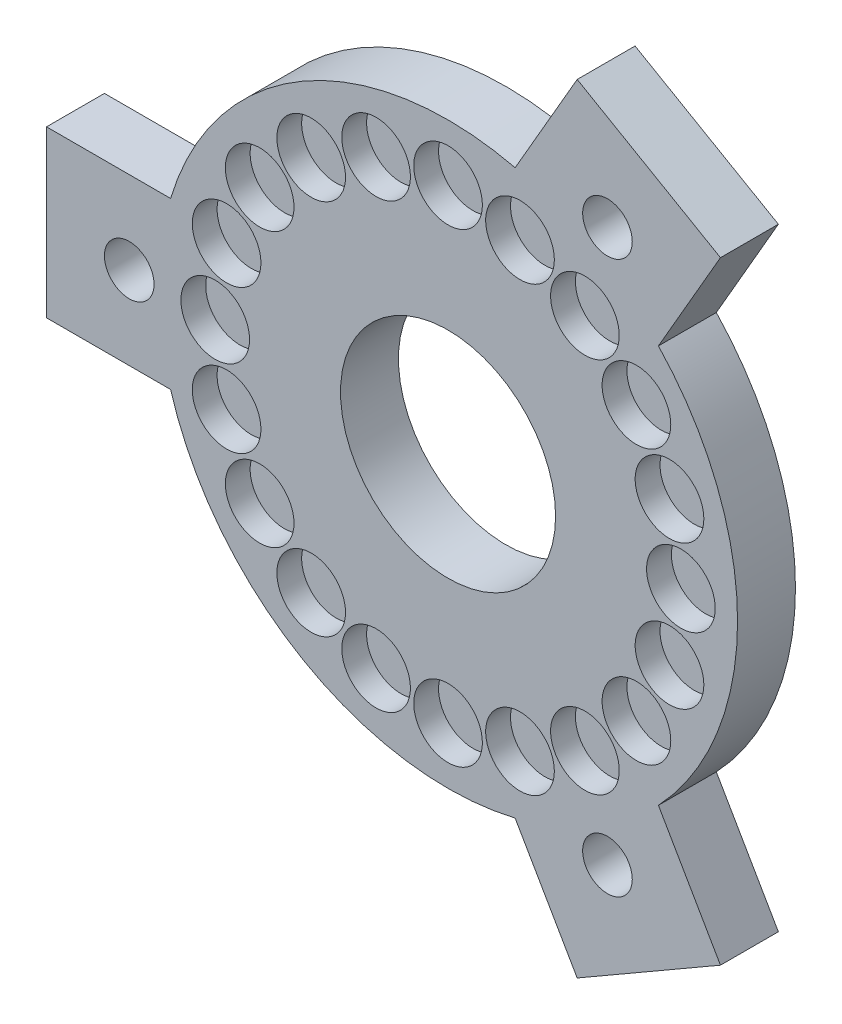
ISO-10303-21;
HEADER;
FILE_DESCRIPTION(('STEP AP214'),'2;1');
FILE_NAME('part.step','',(''),(''),'','','');
FILE_SCHEMA(('AUTOMOTIVE_DESIGN { 1 0 10303 214 1 1 1 1 }'));
ENDSEC;
DATA;
#1=APPLICATION_CONTEXT('core data for automotive mechanical design processes');
#2=APPLICATION_PROTOCOL_DEFINITION('international standard','automotive_design',2000,#1);
#3=PRODUCT_CONTEXT('',#1,'mechanical');
#4=PRODUCT('Part','Part','',(#3));
#5=PRODUCT_RELATED_PRODUCT_CATEGORY('part','',(#4));
#6=PRODUCT_DEFINITION_FORMATION('','',#4);
#7=PRODUCT_DEFINITION_CONTEXT('part definition',#1,'design');
#8=PRODUCT_DEFINITION('design','',#6,#7);
#9=PRODUCT_DEFINITION_SHAPE('','',#8);
#10=(LENGTH_UNIT() NAMED_UNIT(*) SI_UNIT(.MILLI.,.METRE.));
#11=(NAMED_UNIT(*) PLANE_ANGLE_UNIT() SI_UNIT($,.RADIAN.));
#12=(NAMED_UNIT(*) SI_UNIT($,.STERADIAN.) SOLID_ANGLE_UNIT());
#13=UNCERTAINTY_MEASURE_WITH_UNIT(LENGTH_MEASURE(1.E-05),#10,'distance_accuracy_value','');
#14=(GEOMETRIC_REPRESENTATION_CONTEXT(3) GLOBAL_UNCERTAINTY_ASSIGNED_CONTEXT((#13)) GLOBAL_UNIT_ASSIGNED_CONTEXT((#10,
#11,#12)) REPRESENTATION_CONTEXT('',''));
#15=CARTESIAN_POINT('',(0.,0.,0.));
#16=DIRECTION('',(0.,0.,1.));
#17=DIRECTION('',(1.,0.,0.));
#18=AXIS2_PLACEMENT_3D('',#15,#16,#17);
#19=CARTESIAN_POINT('',(0.,0.,7.));
#20=DIRECTION('',(0.,0.,-1.));
#21=DIRECTION('',(-1.,0.,0.));
#22=AXIS2_PLACEMENT_3D('',#19,#20,#21);
#23=CYLINDRICAL_SURFACE('',#22,35.);
#24=CARTESIAN_POINT('',(0.,0.,7.));
#25=DIRECTION('',(0.,0.,1.));
#26=DIRECTION('',(1.,0.,0.));
#27=AXIS2_PLACEMENT_3D('',#24,#25,#26);
#28=CIRCLE('',#27,35.);
#29=CARTESIAN_POINT('',(8.11025579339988,34.0473750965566,7.));
#30=VERTEX_POINT('',#29);
#31=CARTESIAN_POINT('',(-33.5410196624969,10.,7.));
#32=VERTEX_POINT('',#31);
#33=EDGE_CURVE('E126',#30,#32,#28,.T.);
#34=ORIENTED_EDGE('',*,*,#33,.F.);
#35=DIRECTION('',(0.,0.,-1.));
#36=VECTOR('',#35,1.);
#37=CARTESIAN_POINT('',(8.11025579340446,34.047375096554,7.));
#38=LINE('',#37,#36);
#39=CARTESIAN_POINT('',(8.11025579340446,34.047375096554,0.));
#40=VERTEX_POINT('',#39);
#41=EDGE_CURVE('E1253',#30,#40,#38,.T.);
#42=ORIENTED_EDGE('',*,*,#41,.T.);
#43=CARTESIAN_POINT('',(0.,0.,0.));
#44=DIRECTION('',(0.,0.,1.));
#45=DIRECTION('',(1.,0.,0.));
#46=AXIS2_PLACEMENT_3D('',#43,#44,#45);
#47=CIRCLE('',#46,35.);
#48=CARTESIAN_POINT('',(-33.5410196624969,10.,0.));
#49=VERTEX_POINT('',#48);
#50=EDGE_CURVE('E532',#40,#49,#47,.T.);
#51=ORIENTED_EDGE('',*,*,#50,.T.);
#52=DIRECTION('',(0.,0.,-1.));
#53=VECTOR('',#52,1.);
#54=CARTESIAN_POINT('',(-33.5410196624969,10.,7.));
#55=LINE('',#54,#53);
#56=EDGE_CURVE('E251',#32,#49,#55,.T.);
#57=ORIENTED_EDGE('',*,*,#56,.F.);
#58=EDGE_LOOP('',(#34,#42,#51,#57));
#59=FACE_BOUND('',#58,.T.);
#60=ADVANCED_FACE('F116',(#59),#23,.T.);
#61=CARTESIAN_POINT('',(-33.5410196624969,-10.,7.));
#62=VERTEX_POINT('',#61);
#63=CARTESIAN_POINT('',(8.11025579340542,-34.0473750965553,7.));
#64=VERTEX_POINT('',#63);
#65=EDGE_CURVE('E127',#62,#64,#28,.T.);
#66=ORIENTED_EDGE('',*,*,#65,.F.);
#67=DIRECTION('',(0.,0.,-1.));
#68=VECTOR('',#67,1.);
#69=CARTESIAN_POINT('',(-33.5410196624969,-9.99999999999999,7.));
#70=LINE('',#69,#68);
#71=CARTESIAN_POINT('',(-33.5410196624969,-9.99999999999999,0.));
#72=VERTEX_POINT('',#71);
#73=EDGE_CURVE('E255',#62,#72,#70,.T.);
#74=ORIENTED_EDGE('',*,*,#73,.T.);
#75=CARTESIAN_POINT('',(8.11025579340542,-34.0473750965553,0.));
#76=VERTEX_POINT('',#75);
#77=EDGE_CURVE('E487',#72,#76,#47,.T.);
#78=ORIENTED_EDGE('',*,*,#77,.T.);
#79=DIRECTION('',(0.,0.,-1.));
#80=VECTOR('',#79,1.);
#81=CARTESIAN_POINT('',(8.11025579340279,-34.0473750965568,7.));
#82=LINE('',#81,#80);
#83=EDGE_CURVE('E298',#64,#76,#82,.T.);
#84=ORIENTED_EDGE('',*,*,#83,.F.);
#85=EDGE_LOOP('',(#66,#74,#78,#84));
#86=FACE_BOUND('',#85,.T.);
#87=ADVANCED_FACE('F503',(#86),#23,.T.);
#88=CARTESIAN_POINT('',(25.4307638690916,-24.0473750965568,0.));
#89=VERTEX_POINT('',#88);
#90=CARTESIAN_POINT('',(25.4307638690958,24.0473750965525,0.));
#91=VERTEX_POINT('',#90);
#92=EDGE_CURVE('E120',#89,#91,#47,.T.);
#93=ORIENTED_EDGE('',*,*,#92,.T.);
#94=DIRECTION('',(0.,0.,-1.));
#95=VECTOR('',#94,1.);
#96=CARTESIAN_POINT('',(25.4307638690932,24.047375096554,7.));
#97=LINE('',#96,#95);
#98=CARTESIAN_POINT('',(25.4307638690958,24.0473750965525,7.));
#99=VERTEX_POINT('',#98);
#100=EDGE_CURVE('E141',#99,#91,#97,.T.);
#101=ORIENTED_EDGE('',*,*,#100,.F.);
#102=CARTESIAN_POINT('',(25.4307638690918,-24.0473750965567,7.));
#103=VERTEX_POINT('',#102);
#104=EDGE_CURVE('E12',#103,#99,#28,.T.);
#105=ORIENTED_EDGE('',*,*,#104,.F.);
#106=DIRECTION('',(0.,0.,-1.));
#107=VECTOR('',#106,1.);
#108=CARTESIAN_POINT('',(25.4307638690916,-24.0473750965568,7.));
#109=LINE('',#108,#107);
#110=EDGE_CURVE('E316',#103,#89,#109,.T.);
#111=ORIENTED_EDGE('',*,*,#110,.T.);
#112=EDGE_LOOP('',(#93,#101,#105,#111));
#113=FACE_BOUND('',#112,.T.);
#114=ADVANCED_FACE('F118',(#113),#23,.T.);
#115=CARTESIAN_POINT('',(0.,0.,7.));
#116=DIRECTION('',(0.,0.,1.));
#117=DIRECTION('',(1.,0.,0.));
#118=AXIS2_PLACEMENT_3D('',#115,#116,#117);
#119=PLANE('',#118);
#120=CARTESIAN_POINT('',(-38.5410196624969,0.,7.));
#121=DIRECTION('',(0.,0.,1.));
#122=DIRECTION('',(1.,0.,0.));
#123=AXIS2_PLACEMENT_3D('',#120,#121,#122);
#124=CIRCLE('',#123,3.);
#125=CARTESIAN_POINT('',(-35.5410196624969,0.,7.));
#126=VERTEX_POINT('',#125);
#127=EDGE_CURVE('E1227',#126,#126,#124,.F.);
#128=ORIENTED_EDGE('',*,*,#127,.T.);
#129=EDGE_LOOP('',(#128));
#130=FACE_BOUND('',#129,.T.);
#131=CARTESIAN_POINT('',(19.2705098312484,-33.3775021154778,7.));
#132=DIRECTION('',(0.,0.,1.));
#133=DIRECTION('',(1.,0.,0.));
#134=AXIS2_PLACEMENT_3D('',#131,#132,#133);
#135=CIRCLE('',#134,3.);
#136=CARTESIAN_POINT('',(22.2705098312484,-33.3775021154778,7.));
#137=VERTEX_POINT('',#136);
#138=EDGE_CURVE('E1233',#137,#137,#135,.F.);
#139=ORIENTED_EDGE('',*,*,#138,.T.);
#140=EDGE_LOOP('',(#139));
#141=FACE_BOUND('',#140,.T.);
#142=CARTESIAN_POINT('',(19.2705098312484,33.3775021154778,7.));
#143=DIRECTION('',(0.,0.,1.));
#144=DIRECTION('',(1.,0.,0.));
#145=AXIS2_PLACEMENT_3D('',#142,#143,#144);
#146=CIRCLE('',#145,3.);
#147=CARTESIAN_POINT('',(22.2705098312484,33.3775021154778,7.));
#148=VERTEX_POINT('',#147);
#149=EDGE_CURVE('E1243',#148,#148,#146,.F.);
#150=ORIENTED_EDGE('',*,*,#149,.T.);
#151=EDGE_LOOP('',(#150));
#152=FACE_BOUND('',#151,.T.);
#153=ORIENTED_EDGE('',*,*,#104,.T.);
#154=DIRECTION('',(-0.5,-0.866025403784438,0.));
#155=VECTOR('',#154,1.);
#156=CARTESIAN_POINT('',(32.9307638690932,37.0377561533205,7.));
#157=LINE('',#156,#155);
#158=CARTESIAN_POINT('',(32.9307638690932,37.0377561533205,7.));
#159=VERTEX_POINT('',#158);
#160=EDGE_CURVE('E233',#159,#99,#157,.T.);
#161=ORIENTED_EDGE('',*,*,#160,.F.);
#162=DIRECTION('',(0.866025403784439,-0.5,0.));
#163=VECTOR('',#162,1.);
#164=CARTESIAN_POINT('',(32.9307638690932,37.0377561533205,7.));
#165=LINE('',#164,#163);
#166=CARTESIAN_POINT('',(15.6102557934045,47.0377561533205,7.));
#167=VERTEX_POINT('',#166);
#168=EDGE_CURVE('E213',#167,#159,#165,.T.);
#169=ORIENTED_EDGE('',*,*,#168,.F.);
#170=DIRECTION('',(0.500000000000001,0.866025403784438,0.));
#171=VECTOR('',#170,1.);
#172=CARTESIAN_POINT('',(15.6102557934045,47.0377561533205,7.));
#173=LINE('',#172,#171);
#174=EDGE_CURVE('E238',#30,#167,#173,.T.);
#175=ORIENTED_EDGE('',*,*,#174,.F.);
#176=ORIENTED_EDGE('',*,*,#33,.T.);
#177=DIRECTION('',(1.,0.,0.));
#178=VECTOR('',#177,1.);
#179=CARTESIAN_POINT('',(-48.5410196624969,10.,7.));
#180=LINE('',#179,#178);
#181=CARTESIAN_POINT('',(-48.5410196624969,10.,7.));
#182=VERTEX_POINT('',#181);
#183=EDGE_CURVE('E278',#182,#32,#180,.T.);
#184=ORIENTED_EDGE('',*,*,#183,.F.);
#185=DIRECTION('',(0.,1.,0.));
#186=VECTOR('',#185,1.);
#187=CARTESIAN_POINT('',(-48.5410196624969,10.,7.));
#188=LINE('',#187,#186);
#189=CARTESIAN_POINT('',(-48.5410196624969,-9.99999999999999,7.));
#190=VERTEX_POINT('',#189);
#191=EDGE_CURVE('E266',#190,#182,#188,.T.);
#192=ORIENTED_EDGE('',*,*,#191,.F.);
#193=DIRECTION('',(-1.,0.,0.));
#194=VECTOR('',#193,1.);
#195=CARTESIAN_POINT('',(-48.5410196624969,-9.99999999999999,7.));
#196=LINE('',#195,#194);
#197=EDGE_CURVE('E250',#62,#190,#196,.T.);
#198=ORIENTED_EDGE('',*,*,#197,.F.);
#199=ORIENTED_EDGE('',*,*,#65,.T.);
#200=DIRECTION('',(-0.5,0.866025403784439,0.));
#201=VECTOR('',#200,1.);
#202=CARTESIAN_POINT('',(15.6102557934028,-47.0377561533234,7.));
#203=LINE('',#202,#201);
#204=CARTESIAN_POINT('',(15.6102557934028,-47.0377561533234,7.));
#205=VERTEX_POINT('',#204);
#206=EDGE_CURVE('E285',#205,#64,#203,.T.);
#207=ORIENTED_EDGE('',*,*,#206,.F.);
#208=DIRECTION('',(-0.866025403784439,-0.5,0.));
#209=VECTOR('',#208,1.);
#210=CARTESIAN_POINT('',(15.6102557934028,-47.0377561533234,7.));
#211=LINE('',#210,#209);
#212=CARTESIAN_POINT('',(32.9307638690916,-37.0377561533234,7.));
#213=VERTEX_POINT('',#212);
#214=EDGE_CURVE('E294',#213,#205,#211,.T.);
#215=ORIENTED_EDGE('',*,*,#214,.F.);
#216=DIRECTION('',(0.5,-0.866025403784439,0.));
#217=VECTOR('',#216,1.);
#218=CARTESIAN_POINT('',(32.9307638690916,-37.0377561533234,7.));
#219=LINE('',#218,#217);
#220=EDGE_CURVE('E289',#103,#213,#219,.T.);
#221=ORIENTED_EDGE('',*,*,#220,.F.);
#222=EDGE_LOOP('',(#153,#161,#169,#175,#176,#184,#192,#198,#199,#207,#215,#221));
#223=FACE_BOUND('',#222,.T.);
#224=CARTESIAN_POINT('',(0.,0.,7.));
#225=DIRECTION('',(0.,0.,1.));
#226=DIRECTION('',(1.,0.,0.));
#227=AXIS2_PLACEMENT_3D('',#224,#225,#226);
#228=CIRCLE('',#227,13.);
#229=CARTESIAN_POINT('',(13.,0.,7.));
#230=VERTEX_POINT('',#229);
#231=EDGE_CURVE('E312',#230,#230,#228,.T.);
#232=ORIENTED_EDGE('',*,*,#231,.F.);
#233=EDGE_LOOP('',(#232));
#234=FACE_BOUND('',#233,.T.);
#235=CARTESIAN_POINT('',(28.1500000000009,9.17469042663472E-13,7.));
#236=DIRECTION('',(0.,0.,1.));
#237=DIRECTION('',(1.,0.,0.));
#238=AXIS2_PLACEMENT_3D('',#235,#236,#237);
#239=CIRCLE('',#238,4.15);
#240=CARTESIAN_POINT('',(32.3000000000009,9.17469042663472E-13,7.));
#241=VERTEX_POINT('',#240);
#242=EDGE_CURVE('E373',#241,#241,#239,.T.);
#243=ORIENTED_EDGE('',*,*,#242,.F.);
#244=EDGE_LOOP('',(#243));
#245=FACE_BOUND('',#244,.T.);
#246=CARTESIAN_POINT('',(26.7722409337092,8.69882839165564,7.));
#247=DIRECTION('',(0.,0.,1.));
#248=DIRECTION('',(1.,0.,0.));
#249=AXIS2_PLACEMENT_3D('',#246,#247,#248);
#250=CIRCLE('',#249,4.15);
#251=CARTESIAN_POINT('',(30.9222409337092,8.69882839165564,7.));
#252=VERTEX_POINT('',#251);
#253=EDGE_CURVE('E382',#252,#252,#250,.T.);
#254=ORIENTED_EDGE('',*,*,#253,.F.);
#255=EDGE_LOOP('',(#254));
#256=FACE_BOUND('',#255,.T.);
#257=CARTESIAN_POINT('',(22.7738283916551,16.5461548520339,7.));
#258=DIRECTION('',(0.,0.,1.));
#259=DIRECTION('',(1.,0.,0.));
#260=AXIS2_PLACEMENT_3D('',#257,#258,#259);
#261=CIRCLE('',#260,4.15);
#262=CARTESIAN_POINT('',(26.9238283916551,16.5461548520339,7.));
#263=VERTEX_POINT('',#262);
#264=EDGE_CURVE('E355',#263,#263,#261,.T.);
#265=ORIENTED_EDGE('',*,*,#264,.F.);
#266=EDGE_LOOP('',(#265));
#267=FACE_BOUND('',#266,.T.);
#268=CARTESIAN_POINT('',(8.69882839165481,26.7722409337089,7.));
#269=DIRECTION('',(0.,0.,1.));
#270=DIRECTION('',(1.,0.,0.));
#271=AXIS2_PLACEMENT_3D('',#268,#269,#270);
#272=CIRCLE('',#271,4.15);
#273=CARTESIAN_POINT('',(12.8488283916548,26.7722409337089,7.));
#274=VERTEX_POINT('',#273);
#275=EDGE_CURVE('E364',#274,#274,#272,.T.);
#276=ORIENTED_EDGE('',*,*,#275,.F.);
#277=EDGE_LOOP('',(#276));
#278=FACE_BOUND('',#277,.T.);
#279=CARTESIAN_POINT('',(16.5461548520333,22.7738283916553,7.));
#280=DIRECTION('',(0.,0.,1.));
#281=DIRECTION('',(1.,0.,0.));
#282=AXIS2_PLACEMENT_3D('',#279,#280,#281);
#283=CIRCLE('',#282,4.15);
#284=CARTESIAN_POINT('',(20.6961548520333,22.7738283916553,7.));
#285=VERTEX_POINT('',#284);
#286=EDGE_CURVE('E405',#285,#285,#283,.T.);
#287=ORIENTED_EDGE('',*,*,#286,.F.);
#288=EDGE_LOOP('',(#287));
#289=FACE_BOUND('',#288,.T.);
#290=CARTESIAN_POINT('',(8.69882839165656,-26.7722409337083,7.));
#291=DIRECTION('',(0.,0.,1.));
#292=DIRECTION('',(1.,0.,0.));
#293=AXIS2_PLACEMENT_3D('',#290,#291,#292);
#294=CIRCLE('',#293,4.15);
#295=CARTESIAN_POINT('',(12.8488283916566,-26.7722409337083,7.));
#296=VERTEX_POINT('',#295);
#297=EDGE_CURVE('E414',#296,#296,#294,.T.);
#298=ORIENTED_EDGE('',*,*,#297,.F.);
#299=EDGE_LOOP('',(#298));
#300=FACE_BOUND('',#299,.T.);
#301=CARTESIAN_POINT('',(16.5461548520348,-22.7738283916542,7.));
#302=DIRECTION('',(0.,0.,1.));
#303=DIRECTION('',(1.,0.,0.));
#304=AXIS2_PLACEMENT_3D('',#301,#302,#303);
#305=CIRCLE('',#304,4.15);
#306=CARTESIAN_POINT('',(20.6961548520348,-22.7738283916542,7.));
#307=VERTEX_POINT('',#306);
#308=EDGE_CURVE('E389',#307,#307,#305,.T.);
#309=ORIENTED_EDGE('',*,*,#308,.F.);
#310=EDGE_LOOP('',(#309));
#311=FACE_BOUND('',#310,.T.);
#312=CARTESIAN_POINT('',(26.7722409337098,-8.6988283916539,7.));
#313=DIRECTION('',(0.,0.,1.));
#314=DIRECTION('',(1.,0.,0.));
#315=AXIS2_PLACEMENT_3D('',#312,#313,#314);
#316=CIRCLE('',#315,4.15);
#317=CARTESIAN_POINT('',(30.9222409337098,-8.6988283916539,7.));
#318=VERTEX_POINT('',#317);
#319=EDGE_CURVE('E398',#318,#318,#316,.T.);
#320=ORIENTED_EDGE('',*,*,#319,.F.);
#321=EDGE_LOOP('',(#320));
#322=FACE_BOUND('',#321,.T.);
#323=CARTESIAN_POINT('',(-26.7722409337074,-8.69882839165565,7.));
#324=DIRECTION('',(0.,0.,1.));
#325=DIRECTION('',(1.,0.,0.));
#326=AXIS2_PLACEMENT_3D('',#323,#324,#325);
#327=CIRCLE('',#326,4.15);
#328=CARTESIAN_POINT('',(-22.6222409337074,-8.69882839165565,7.));
#329=VERTEX_POINT('',#328);
#330=EDGE_CURVE('E438',#329,#329,#327,.T.);
#331=ORIENTED_EDGE('',*,*,#330,.F.);
#332=EDGE_LOOP('',(#331));
#333=FACE_BOUND('',#332,.T.);
#334=CARTESIAN_POINT('',(-22.7738283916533,-16.5461548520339,7.));
#335=DIRECTION('',(0.,0.,1.));
#336=DIRECTION('',(1.,0.,0.));
#337=AXIS2_PLACEMENT_3D('',#334,#335,#336);
#338=CIRCLE('',#337,4.15);
#339=CARTESIAN_POINT('',(-18.6238283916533,-16.5461548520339,7.));
#340=VERTEX_POINT('',#339);
#341=EDGE_CURVE('E439',#340,#340,#338,.T.);
#342=ORIENTED_EDGE('',*,*,#341,.F.);
#343=EDGE_LOOP('',(#342));
#344=FACE_BOUND('',#343,.T.);
#345=CARTESIAN_POINT('',(-28.1499999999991,-9.20916423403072E-13,7.));
#346=DIRECTION('',(0.,0.,1.));
#347=DIRECTION('',(1.,0.,0.));
#348=AXIS2_PLACEMENT_3D('',#345,#346,#347);
#349=CIRCLE('',#348,4.15);
#350=CARTESIAN_POINT('',(-23.9999999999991,-9.20916423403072E-13,7.));
#351=VERTEX_POINT('',#350);
#352=EDGE_CURVE('E430',#351,#351,#349,.T.);
#353=ORIENTED_EDGE('',*,*,#352,.F.);
#354=EDGE_LOOP('',(#353));
#355=FACE_BOUND('',#354,.T.);
#356=CARTESIAN_POINT('',(-26.7722409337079,8.69882839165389,7.));
#357=DIRECTION('',(0.,0.,1.));
#358=DIRECTION('',(1.,0.,0.));
#359=AXIS2_PLACEMENT_3D('',#356,#357,#358);
#360=CIRCLE('',#359,4.15);
#361=CARTESIAN_POINT('',(-22.6222409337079,8.69882839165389,7.));
#362=VERTEX_POINT('',#361);
#363=EDGE_CURVE('E421',#362,#362,#360,.T.);
#364=ORIENTED_EDGE('',*,*,#363,.F.);
#365=EDGE_LOOP('',(#364));
#366=FACE_BOUND('',#365,.T.);
#367=CARTESIAN_POINT('',(0.,28.15,7.));
#368=DIRECTION('',(0.,0.,1.));
#369=DIRECTION('',(1.,0.,0.));
#370=AXIS2_PLACEMENT_3D('',#367,#368,#369);
#371=CIRCLE('',#370,4.15);
#372=CARTESIAN_POINT('',(4.15,28.15,7.));
#373=VERTEX_POINT('',#372);
#374=EDGE_CURVE('E372',#373,#373,#371,.T.);
#375=ORIENTED_EDGE('',*,*,#374,.F.);
#376=EDGE_LOOP('',(#375));
#377=FACE_BOUND('',#376,.T.);
#378=CARTESIAN_POINT('',(-8.69882839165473,26.7722409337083,7.));
#379=DIRECTION('',(0.,0.,1.));
#380=DIRECTION('',(1.,0.,0.));
#381=AXIS2_PLACEMENT_3D('',#378,#379,#380);
#382=CIRCLE('',#381,4.15);
#383=CARTESIAN_POINT('',(-4.54882839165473,26.7722409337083,7.));
#384=VERTEX_POINT('',#383);
#385=EDGE_CURVE('E476',#384,#384,#382,.T.);
#386=ORIENTED_EDGE('',*,*,#385,.F.);
#387=EDGE_LOOP('',(#386));
#388=FACE_BOUND('',#387,.T.);
#389=CARTESIAN_POINT('',(-22.7738283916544,16.5461548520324,7.));
#390=DIRECTION('',(0.,0.,1.));
#391=DIRECTION('',(1.,0.,0.));
#392=AXIS2_PLACEMENT_3D('',#389,#390,#391);
#393=CIRCLE('',#392,4.15);
#394=CARTESIAN_POINT('',(-18.6238283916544,16.5461548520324,7.));
#395=VERTEX_POINT('',#394);
#396=EDGE_CURVE('E453',#395,#395,#393,.T.);
#397=ORIENTED_EDGE('',*,*,#396,.F.);
#398=EDGE_LOOP('',(#397));
#399=FACE_BOUND('',#398,.T.);
#400=CARTESIAN_POINT('',(-16.546154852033,22.7738283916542,7.));
#401=DIRECTION('',(0.,0.,1.));
#402=DIRECTION('',(1.,0.,0.));
#403=AXIS2_PLACEMENT_3D('',#400,#401,#402);
#404=CIRCLE('',#403,4.15);
#405=CARTESIAN_POINT('',(-12.396154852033,22.7738283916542,7.));
#406=VERTEX_POINT('',#405);
#407=EDGE_CURVE('E461',#406,#406,#404,.T.);
#408=ORIENTED_EDGE('',*,*,#407,.F.);
#409=EDGE_LOOP('',(#408));
#410=FACE_BOUND('',#409,.T.);
#411=CARTESIAN_POINT('',(-8.69882839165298,-26.7722409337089,7.));
#412=DIRECTION('',(0.,0.,1.));
#413=DIRECTION('',(1.,0.,0.));
#414=AXIS2_PLACEMENT_3D('',#411,#412,#413);
#415=CIRCLE('',#414,4.15);
#416=CARTESIAN_POINT('',(-4.54882839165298,-26.7722409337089,7.));
#417=VERTEX_POINT('',#416);
#418=EDGE_CURVE('E331',#417,#417,#415,.T.);
#419=ORIENTED_EDGE('',*,*,#418,.F.);
#420=EDGE_LOOP('',(#419));
#421=FACE_BOUND('',#420,.T.);
#422=CARTESIAN_POINT('',(-16.5461548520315,-22.7738283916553,7.));
#423=DIRECTION('',(0.,0.,1.));
#424=DIRECTION('',(1.,0.,0.));
#425=AXIS2_PLACEMENT_3D('',#422,#423,#424);
#426=CIRCLE('',#425,4.15);
#427=CARTESIAN_POINT('',(-12.3961548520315,-22.7738283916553,7.));
#428=VERTEX_POINT('',#427);
#429=EDGE_CURVE('E341',#428,#428,#426,.T.);
#430=ORIENTED_EDGE('',*,*,#429,.F.);
#431=EDGE_LOOP('',(#430));
#432=FACE_BOUND('',#431,.T.);
#433=CARTESIAN_POINT('',(1.83493808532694E-12,-28.15,7.));
#434=DIRECTION('',(0.,0.,1.));
#435=DIRECTION('',(1.,0.,0.));
#436=AXIS2_PLACEMENT_3D('',#433,#434,#435);
#437=CIRCLE('',#436,4.15);
#438=CARTESIAN_POINT('',(4.15000000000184,-28.15,7.));
#439=VERTEX_POINT('',#438);
#440=EDGE_CURVE('E340',#439,#439,#437,.T.);
#441=ORIENTED_EDGE('',*,*,#440,.F.);
#442=EDGE_LOOP('',(#441));
#443=FACE_BOUND('',#442,.T.);
#444=CARTESIAN_POINT('',(22.7738283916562,-16.5461548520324,7.));
#445=DIRECTION('',(0.,0.,1.));
#446=DIRECTION('',(1.,0.,0.));
#447=AXIS2_PLACEMENT_3D('',#444,#445,#446);
#448=CIRCLE('',#447,4.15);
#449=CARTESIAN_POINT('',(26.9238283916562,-16.5461548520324,7.));
#450=VERTEX_POINT('',#449);
#451=EDGE_CURVE('E409',#450,#450,#448,.T.);
#452=ORIENTED_EDGE('',*,*,#451,.F.);
#453=EDGE_LOOP('',(#452));
#454=FACE_BOUND('',#453,.T.);
#455=ADVANCED_FACE('F494',(#130,#141,#152,#223,#234,#245,#256,#267,#278,#289,#300,#311,#322,
#333,#344,#355,#366,#377,#388,#399,#410,#421,#432,#443,#454),#119,.T.);
#456=CARTESIAN_POINT('',(0.,0.,0.));
#457=DIRECTION('',(0.,0.,1.));
#458=DIRECTION('',(1.,0.,0.));
#459=AXIS2_PLACEMENT_3D('',#456,#457,#458);
#460=PLANE('',#459);
#461=CARTESIAN_POINT('',(-38.5410196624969,0.,0.));
#462=DIRECTION('',(0.,0.,-1.));
#463=DIRECTION('',(-1.,0.,0.));
#464=AXIS2_PLACEMENT_3D('',#461,#462,#463);
#465=CIRCLE('',#464,3.);
#466=CARTESIAN_POINT('',(-41.5410196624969,0.,0.));
#467=VERTEX_POINT('',#466);
#468=EDGE_CURVE('E219',#467,#467,#465,.T.);
#469=ORIENTED_EDGE('',*,*,#468,.F.);
#470=EDGE_LOOP('',(#469));
#471=FACE_BOUND('',#470,.T.);
#472=CARTESIAN_POINT('',(19.2705098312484,-33.3775021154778,0.));
#473=DIRECTION('',(0.,0.,-1.));
#474=DIRECTION('',(-1.,0.,0.));
#475=AXIS2_PLACEMENT_3D('',#472,#473,#474);
#476=CIRCLE('',#475,3.);
#477=CARTESIAN_POINT('',(16.2705098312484,-33.3775021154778,0.));
#478=VERTEX_POINT('',#477);
#479=EDGE_CURVE('E1239',#478,#478,#476,.T.);
#480=ORIENTED_EDGE('',*,*,#479,.F.);
#481=EDGE_LOOP('',(#480));
#482=FACE_BOUND('',#481,.T.);
#483=CARTESIAN_POINT('',(19.2705098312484,33.3775021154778,0.));
#484=DIRECTION('',(0.,0.,-1.));
#485=DIRECTION('',(-1.,0.,0.));
#486=AXIS2_PLACEMENT_3D('',#483,#484,#485);
#487=CIRCLE('',#486,3.);
#488=CARTESIAN_POINT('',(16.2705098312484,33.3775021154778,0.));
#489=VERTEX_POINT('',#488);
#490=EDGE_CURVE('E1247',#489,#489,#487,.T.);
#491=ORIENTED_EDGE('',*,*,#490,.F.);
#492=EDGE_LOOP('',(#491));
#493=FACE_BOUND('',#492,.T.);
#494=CARTESIAN_POINT('',(0.,0.,0.));
#495=DIRECTION('',(0.,0.,1.));
#496=DIRECTION('',(1.,0.,0.));
#497=AXIS2_PLACEMENT_3D('',#494,#495,#496);
#498=CIRCLE('',#497,13.);
#499=CARTESIAN_POINT('',(13.,0.,0.));
#500=VERTEX_POINT('',#499);
#501=EDGE_CURVE('E326',#500,#500,#498,.F.);
#502=ORIENTED_EDGE('',*,*,#501,.F.);
#503=EDGE_LOOP('',(#502));
#504=FACE_BOUND('',#503,.T.);
#505=ORIENTED_EDGE('',*,*,#50,.F.);
#506=DIRECTION('',(0.500000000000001,0.866025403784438,0.));
#507=VECTOR('',#506,1.);
#508=CARTESIAN_POINT('',(15.6102557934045,47.0377561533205,0.));
#509=LINE('',#508,#507);
#510=CARTESIAN_POINT('',(15.6102557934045,47.0377561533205,0.));
#511=VERTEX_POINT('',#510);
#512=EDGE_CURVE('E227',#40,#511,#509,.T.);
#513=ORIENTED_EDGE('',*,*,#512,.T.);
#514=DIRECTION('',(0.866025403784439,-0.5,0.));
#515=VECTOR('',#514,1.);
#516=CARTESIAN_POINT('',(32.9307638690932,37.0377561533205,0.));
#517=LINE('',#516,#515);
#518=CARTESIAN_POINT('',(32.9307638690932,37.0377561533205,0.));
#519=VERTEX_POINT('',#518);
#520=EDGE_CURVE('E211',#511,#519,#517,.T.);
#521=ORIENTED_EDGE('',*,*,#520,.T.);
#522=DIRECTION('',(-0.5,-0.866025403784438,0.));
#523=VECTOR('',#522,1.);
#524=CARTESIAN_POINT('',(32.9307638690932,37.0377561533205,0.));
#525=LINE('',#524,#523);
#526=EDGE_CURVE('E222',#519,#91,#525,.T.);
#527=ORIENTED_EDGE('',*,*,#526,.T.);
#528=ORIENTED_EDGE('',*,*,#92,.F.);
#529=DIRECTION('',(0.5,-0.866025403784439,0.));
#530=VECTOR('',#529,1.);
#531=CARTESIAN_POINT('',(32.9307638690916,-37.0377561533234,0.));
#532=LINE('',#531,#530);
#533=CARTESIAN_POINT('',(32.9307638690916,-37.0377561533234,0.));
#534=VERTEX_POINT('',#533);
#535=EDGE_CURVE('E302',#89,#534,#532,.T.);
#536=ORIENTED_EDGE('',*,*,#535,.T.);
#537=DIRECTION('',(-0.866025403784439,-0.5,0.));
#538=VECTOR('',#537,1.);
#539=CARTESIAN_POINT('',(15.6102557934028,-47.0377561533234,0.));
#540=LINE('',#539,#538);
#541=CARTESIAN_POINT('',(15.6102557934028,-47.0377561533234,0.));
#542=VERTEX_POINT('',#541);
#543=EDGE_CURVE('E290',#534,#542,#540,.T.);
#544=ORIENTED_EDGE('',*,*,#543,.T.);
#545=DIRECTION('',(-0.5,0.866025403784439,0.));
#546=VECTOR('',#545,1.);
#547=CARTESIAN_POINT('',(15.6102557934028,-47.0377561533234,0.));
#548=LINE('',#547,#546);
#549=EDGE_CURVE('E274',#542,#76,#548,.T.);
#550=ORIENTED_EDGE('',*,*,#549,.T.);
#551=ORIENTED_EDGE('',*,*,#77,.F.);
#552=DIRECTION('',(-1.,0.,0.));
#553=VECTOR('',#552,1.);
#554=CARTESIAN_POINT('',(-48.5410196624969,-9.99999999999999,0.));
#555=LINE('',#554,#553);
#556=CARTESIAN_POINT('',(-48.5410196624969,-9.99999999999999,0.));
#557=VERTEX_POINT('',#556);
#558=EDGE_CURVE('E261',#72,#557,#555,.T.);
#559=ORIENTED_EDGE('',*,*,#558,.T.);
#560=DIRECTION('',(0.,1.,0.));
#561=VECTOR('',#560,1.);
#562=CARTESIAN_POINT('',(-48.5410196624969,10.,0.));
#563=LINE('',#562,#561);
#564=CARTESIAN_POINT('',(-48.5410196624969,10.,0.));
#565=VERTEX_POINT('',#564);
#566=EDGE_CURVE('E270',#557,#565,#563,.T.);
#567=ORIENTED_EDGE('',*,*,#566,.T.);
#568=DIRECTION('',(1.,0.,0.));
#569=VECTOR('',#568,1.);
#570=CARTESIAN_POINT('',(-48.5410196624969,10.,0.));
#571=LINE('',#570,#569);
#572=EDGE_CURVE('E265',#565,#49,#571,.T.);
#573=ORIENTED_EDGE('',*,*,#572,.T.);
#574=EDGE_LOOP('',(#505,#513,#521,#527,#528,#536,#544,#550,#551,#559,#567,#573));
#575=FACE_BOUND('',#574,.T.);
#576=ADVANCED_FACE('F230',(#471,#482,#493,#504,#575),#460,.F.);
#577=CARTESIAN_POINT('',(22.7738283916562,-16.5461548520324,4.));
#578=DIRECTION('',(0.,0.,1.));
#579=DIRECTION('',(1.,0.,0.));
#580=AXIS2_PLACEMENT_3D('',#577,#578,#579);
#581=CYLINDRICAL_SURFACE('',#580,4.15);
#582=CARTESIAN_POINT('',(22.7738283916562,-16.5461548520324,4.));
#583=DIRECTION('',(0.,0.,1.));
#584=DIRECTION('',(1.,0.,0.));
#585=AXIS2_PLACEMENT_3D('',#582,#583,#584);
#586=CIRCLE('',#585,4.15);
#587=CARTESIAN_POINT('',(26.9238283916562,-16.5461548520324,4.));
#588=VERTEX_POINT('',#587);
#589=EDGE_CURVE('E483',#588,#588,#586,.T.);
#590=ORIENTED_EDGE('',*,*,#589,.F.);
#591=EDGE_LOOP('',(#590));
#592=FACE_BOUND('',#591,.T.);
#593=ORIENTED_EDGE('',*,*,#451,.T.);
#594=EDGE_LOOP('',(#593));
#595=FACE_BOUND('',#594,.T.);
#596=ADVANCED_FACE('F492',(#592,#595),#581,.F.);
#597=CARTESIAN_POINT('',(0.,0.,4.));
#598=DIRECTION('',(0.,0.,1.));
#599=DIRECTION('',(1.,0.,0.));
#600=AXIS2_PLACEMENT_3D('',#597,#598,#599);
#601=PLANE('',#600);
#602=ORIENTED_EDGE('',*,*,#589,.T.);
#603=EDGE_LOOP('',(#602));
#604=FACE_BOUND('',#603,.T.);
#605=ADVANCED_FACE('F584',(#604),#601,.T.);
#606=CARTESIAN_POINT('',(1.83493808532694E-12,-28.15,4.));
#607=DIRECTION('',(0.,0.,1.));
#608=DIRECTION('',(1.,0.,0.));
#609=AXIS2_PLACEMENT_3D('',#606,#607,#608);
#610=CYLINDRICAL_SURFACE('',#609,4.15);
#611=CARTESIAN_POINT('',(1.83493808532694E-12,-28.15,4.));
#612=DIRECTION('',(0.,0.,1.));
#613=DIRECTION('',(1.,0.,0.));
#614=AXIS2_PLACEMENT_3D('',#611,#612,#613);
#615=CIRCLE('',#614,4.15);
#616=CARTESIAN_POINT('',(4.15000000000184,-28.15,4.));
#617=VERTEX_POINT('',#616);
#618=EDGE_CURVE('E330',#617,#617,#615,.T.);
#619=ORIENTED_EDGE('',*,*,#618,.F.);
#620=EDGE_LOOP('',(#619));
#621=FACE_BOUND('',#620,.T.);
#622=ORIENTED_EDGE('',*,*,#440,.T.);
#623=EDGE_LOOP('',(#622));
#624=FACE_BOUND('',#623,.T.);
#625=ADVANCED_FACE('F581',(#621,#624),#610,.F.);
#626=CARTESIAN_POINT('',(1.83493808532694E-12,-28.15,4.));
#627=DIRECTION('',(0.,0.,1.));
#628=DIRECTION('',(1.,0.,0.));
#629=AXIS2_PLACEMENT_3D('',#626,#627,#628);
#630=PLANE('',#629);
#631=ORIENTED_EDGE('',*,*,#618,.T.);
#632=EDGE_LOOP('',(#631));
#633=FACE_BOUND('',#632,.T.);
#634=ADVANCED_FACE('F576',(#633),#630,.T.);
#635=CARTESIAN_POINT('',(-16.5461548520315,-22.7738283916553,4.));
#636=DIRECTION('',(0.,0.,1.));
#637=DIRECTION('',(1.,0.,0.));
#638=AXIS2_PLACEMENT_3D('',#635,#636,#637);
#639=CYLINDRICAL_SURFACE('',#638,4.15);
#640=CARTESIAN_POINT('',(-16.5461548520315,-22.7738283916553,4.));
#641=DIRECTION('',(0.,0.,1.));
#642=DIRECTION('',(1.,0.,0.));
#643=AXIS2_PLACEMENT_3D('',#640,#641,#642);
#644=CIRCLE('',#643,4.15);
#645=CARTESIAN_POINT('',(-12.3961548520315,-22.7738283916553,4.));
#646=VERTEX_POINT('',#645);
#647=EDGE_CURVE('E335',#646,#646,#644,.T.);
#648=ORIENTED_EDGE('',*,*,#647,.F.);
#649=EDGE_LOOP('',(#648));
#650=FACE_BOUND('',#649,.T.);
#651=ORIENTED_EDGE('',*,*,#429,.T.);
#652=EDGE_LOOP('',(#651));
#653=FACE_BOUND('',#652,.T.);
#654=ADVANCED_FACE('F573',(#650,#653),#639,.F.);
#655=CARTESIAN_POINT('',(-16.5461548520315,-22.7738283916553,4.));
#656=DIRECTION('',(0.,0.,1.));
#657=DIRECTION('',(1.,0.,0.));
#658=AXIS2_PLACEMENT_3D('',#655,#656,#657);
#659=PLANE('',#658);
#660=ORIENTED_EDGE('',*,*,#647,.T.);
#661=EDGE_LOOP('',(#660));
#662=FACE_BOUND('',#661,.T.);
#663=ADVANCED_FACE('F567',(#662),#659,.T.);
#664=CARTESIAN_POINT('',(-8.69882839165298,-26.7722409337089,4.));
#665=DIRECTION('',(0.,0.,1.));
#666=DIRECTION('',(1.,0.,0.));
#667=AXIS2_PLACEMENT_3D('',#664,#665,#666);
#668=CYLINDRICAL_SURFACE('',#667,4.15);
#669=CARTESIAN_POINT('',(-8.69882839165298,-26.7722409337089,4.));
#670=DIRECTION('',(0.,0.,1.));
#671=DIRECTION('',(1.,0.,0.));
#672=AXIS2_PLACEMENT_3D('',#669,#670,#671);
#673=CIRCLE('',#672,4.15);
#674=CARTESIAN_POINT('',(-4.54882839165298,-26.7722409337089,4.));
#675=VERTEX_POINT('',#674);
#676=EDGE_CURVE('E336',#675,#675,#673,.T.);
#677=ORIENTED_EDGE('',*,*,#676,.F.);
#678=EDGE_LOOP('',(#677));
#679=FACE_BOUND('',#678,.T.);
#680=ORIENTED_EDGE('',*,*,#418,.T.);
#681=EDGE_LOOP('',(#680));
#682=FACE_BOUND('',#681,.T.);
#683=ADVANCED_FACE('F563',(#679,#682),#668,.F.);
#684=CARTESIAN_POINT('',(-8.69882839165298,-26.7722409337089,4.));
#685=DIRECTION('',(0.,0.,1.));
#686=DIRECTION('',(1.,0.,0.));
#687=AXIS2_PLACEMENT_3D('',#684,#685,#686);
#688=PLANE('',#687);
#689=ORIENTED_EDGE('',*,*,#676,.T.);
#690=EDGE_LOOP('',(#689));
#691=FACE_BOUND('',#690,.T.);
#692=ADVANCED_FACE('F566',(#691),#688,.T.);
#693=CARTESIAN_POINT('',(-16.546154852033,22.7738283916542,4.));
#694=DIRECTION('',(0.,0.,1.));
#695=DIRECTION('',(1.,0.,0.));
#696=AXIS2_PLACEMENT_3D('',#693,#694,#695);
#697=CYLINDRICAL_SURFACE('',#696,4.15);
#698=CARTESIAN_POINT('',(-16.546154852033,22.7738283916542,4.));
#699=DIRECTION('',(0.,0.,1.));
#700=DIRECTION('',(1.,0.,0.));
#701=AXIS2_PLACEMENT_3D('',#698,#699,#700);
#702=CIRCLE('',#701,4.15);
#703=CARTESIAN_POINT('',(-12.396154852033,22.7738283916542,4.));
#704=VERTEX_POINT('',#703);
#705=EDGE_CURVE('E457',#704,#704,#702,.T.);
#706=ORIENTED_EDGE('',*,*,#705,.F.);
#707=EDGE_LOOP('',(#706));
#708=FACE_BOUND('',#707,.T.);
#709=ORIENTED_EDGE('',*,*,#407,.T.);
#710=EDGE_LOOP('',(#709));
#711=FACE_BOUND('',#710,.T.);
#712=ADVANCED_FACE('F571',(#708,#711),#697,.F.);
#713=CARTESIAN_POINT('',(-16.546154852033,22.7738283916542,4.));
#714=DIRECTION('',(0.,0.,1.));
#715=DIRECTION('',(1.,0.,0.));
#716=AXIS2_PLACEMENT_3D('',#713,#714,#715);
#717=PLANE('',#716);
#718=ORIENTED_EDGE('',*,*,#705,.T.);
#719=EDGE_LOOP('',(#718));
#720=FACE_BOUND('',#719,.T.);
#721=ADVANCED_FACE('F689',(#720),#717,.T.);
#722=CARTESIAN_POINT('',(-22.7738283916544,16.5461548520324,4.));
#723=DIRECTION('',(0.,0.,1.));
#724=DIRECTION('',(1.,0.,0.));
#725=AXIS2_PLACEMENT_3D('',#722,#723,#724);
#726=CYLINDRICAL_SURFACE('',#725,4.15);
#727=CARTESIAN_POINT('',(-22.7738283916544,16.5461548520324,4.));
#728=DIRECTION('',(0.,0.,1.));
#729=DIRECTION('',(1.,0.,0.));
#730=AXIS2_PLACEMENT_3D('',#727,#728,#729);
#731=CIRCLE('',#730,4.15);
#732=CARTESIAN_POINT('',(-18.6238283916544,16.5461548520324,4.));
#733=VERTEX_POINT('',#732);
#734=EDGE_CURVE('E425',#733,#733,#731,.T.);
#735=ORIENTED_EDGE('',*,*,#734,.F.);
#736=EDGE_LOOP('',(#735));
#737=FACE_BOUND('',#736,.T.);
#738=ORIENTED_EDGE('',*,*,#396,.T.);
#739=EDGE_LOOP('',(#738));
#740=FACE_BOUND('',#739,.T.);
#741=ADVANCED_FACE('F685',(#737,#740),#726,.F.);
#742=CARTESIAN_POINT('',(-22.7738283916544,16.5461548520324,4.));
#743=DIRECTION('',(0.,0.,1.));
#744=DIRECTION('',(1.,0.,0.));
#745=AXIS2_PLACEMENT_3D('',#742,#743,#744);
#746=PLANE('',#745);
#747=ORIENTED_EDGE('',*,*,#734,.T.);
#748=EDGE_LOOP('',(#747));
#749=FACE_BOUND('',#748,.T.);
#750=ADVANCED_FACE('F688',(#749),#746,.T.);
#751=CARTESIAN_POINT('',(-8.69882839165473,26.7722409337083,4.));
#752=DIRECTION('',(0.,0.,1.));
#753=DIRECTION('',(1.,0.,0.));
#754=AXIS2_PLACEMENT_3D('',#751,#752,#753);
#755=CYLINDRICAL_SURFACE('',#754,4.15);
#756=CARTESIAN_POINT('',(-8.69882839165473,26.7722409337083,4.));
#757=DIRECTION('',(0.,0.,1.));
#758=DIRECTION('',(1.,0.,0.));
#759=AXIS2_PLACEMENT_3D('',#756,#757,#758);
#760=CIRCLE('',#759,4.15);
#761=CARTESIAN_POINT('',(-4.54882839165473,26.7722409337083,4.));
#762=VERTEX_POINT('',#761);
#763=EDGE_CURVE('E465',#762,#762,#760,.T.);
#764=ORIENTED_EDGE('',*,*,#763,.F.);
#765=EDGE_LOOP('',(#764));
#766=FACE_BOUND('',#765,.T.);
#767=ORIENTED_EDGE('',*,*,#385,.T.);
#768=EDGE_LOOP('',(#767));
#769=FACE_BOUND('',#768,.T.);
#770=ADVANCED_FACE('F693',(#766,#769),#755,.F.);
#771=CARTESIAN_POINT('',(-8.69882839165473,26.7722409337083,4.));
#772=DIRECTION('',(0.,0.,1.));
#773=DIRECTION('',(1.,0.,0.));
#774=AXIS2_PLACEMENT_3D('',#771,#772,#773);
#775=PLANE('',#774);
#776=ORIENTED_EDGE('',*,*,#763,.T.);
#777=EDGE_LOOP('',(#776));
#778=FACE_BOUND('',#777,.T.);
#779=ADVANCED_FACE('F704',(#778),#775,.T.);
#780=CARTESIAN_POINT('',(0.,28.15,4.));
#781=DIRECTION('',(0.,0.,1.));
#782=DIRECTION('',(1.,0.,0.));
#783=AXIS2_PLACEMENT_3D('',#780,#781,#782);
#784=CYLINDRICAL_SURFACE('',#783,4.15);
#785=CARTESIAN_POINT('',(0.,28.15,4.));
#786=DIRECTION('',(0.,0.,1.));
#787=DIRECTION('',(1.,0.,0.));
#788=AXIS2_PLACEMENT_3D('',#785,#786,#787);
#789=CIRCLE('',#788,4.15);
#790=CARTESIAN_POINT('',(4.15,28.15,4.));
#791=VERTEX_POINT('',#790);
#792=EDGE_CURVE('E472',#791,#791,#789,.T.);
#793=ORIENTED_EDGE('',*,*,#792,.F.);
#794=EDGE_LOOP('',(#793));
#795=FACE_BOUND('',#794,.T.);
#796=ORIENTED_EDGE('',*,*,#374,.T.);
#797=EDGE_LOOP('',(#796));
#798=FACE_BOUND('',#797,.T.);
#799=ADVANCED_FACE('F701',(#795,#798),#784,.F.);
#800=CARTESIAN_POINT('',(0.,28.15,4.));
#801=DIRECTION('',(0.,0.,1.));
#802=DIRECTION('',(1.,0.,0.));
#803=AXIS2_PLACEMENT_3D('',#800,#801,#802);
#804=PLANE('',#803);
#805=ORIENTED_EDGE('',*,*,#792,.T.);
#806=EDGE_LOOP('',(#805));
#807=FACE_BOUND('',#806,.T.);
#808=ADVANCED_FACE('F657',(#807),#804,.T.);
#809=CARTESIAN_POINT('',(-26.7722409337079,8.69882839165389,4.));
#810=DIRECTION('',(0.,0.,1.));
#811=DIRECTION('',(1.,0.,0.));
#812=AXIS2_PLACEMENT_3D('',#809,#810,#811);
#813=CYLINDRICAL_SURFACE('',#812,4.15);
#814=CARTESIAN_POINT('',(-26.7722409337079,8.69882839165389,4.));
#815=DIRECTION('',(0.,0.,1.));
#816=DIRECTION('',(1.,0.,0.));
#817=AXIS2_PLACEMENT_3D('',#814,#815,#816);
#818=CIRCLE('',#817,4.15);
#819=CARTESIAN_POINT('',(-22.6222409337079,8.69882839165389,4.));
#820=VERTEX_POINT('',#819);
#821=EDGE_CURVE('E426',#820,#820,#818,.T.);
#822=ORIENTED_EDGE('',*,*,#821,.F.);
#823=EDGE_LOOP('',(#822));
#824=FACE_BOUND('',#823,.T.);
#825=ORIENTED_EDGE('',*,*,#363,.T.);
#826=EDGE_LOOP('',(#825));
#827=FACE_BOUND('',#826,.T.);
#828=ADVANCED_FACE('F653',(#824,#827),#813,.F.);
#829=CARTESIAN_POINT('',(-26.7722409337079,8.69882839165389,4.));
#830=DIRECTION('',(0.,0.,1.));
#831=DIRECTION('',(1.,0.,0.));
#832=AXIS2_PLACEMENT_3D('',#829,#830,#831);
#833=PLANE('',#832);
#834=ORIENTED_EDGE('',*,*,#821,.T.);
#835=EDGE_LOOP('',(#834));
#836=FACE_BOUND('',#835,.T.);
#837=ADVANCED_FACE('F656',(#836),#833,.T.);
#838=CARTESIAN_POINT('',(-28.1499999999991,-9.20916423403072E-13,4.));
#839=DIRECTION('',(0.,0.,1.));
#840=DIRECTION('',(1.,0.,0.));
#841=AXIS2_PLACEMENT_3D('',#838,#839,#840);
#842=CYLINDRICAL_SURFACE('',#841,4.15);
#843=CARTESIAN_POINT('',(-28.1499999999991,-9.20916423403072E-13,4.));
#844=DIRECTION('',(0.,0.,1.));
#845=DIRECTION('',(1.,0.,0.));
#846=AXIS2_PLACEMENT_3D('',#843,#844,#845);
#847=CIRCLE('',#846,4.15);
#848=CARTESIAN_POINT('',(-23.9999999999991,-9.20916423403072E-13,4.));
#849=VERTEX_POINT('',#848);
#850=EDGE_CURVE('E434',#849,#849,#847,.T.);
#851=ORIENTED_EDGE('',*,*,#850,.F.);
#852=EDGE_LOOP('',(#851));
#853=FACE_BOUND('',#852,.T.);
#854=ORIENTED_EDGE('',*,*,#352,.T.);
#855=EDGE_LOOP('',(#854));
#856=FACE_BOUND('',#855,.T.);
#857=ADVANCED_FACE('F661',(#853,#856),#842,.F.);
#858=CARTESIAN_POINT('',(-28.1499999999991,-9.20916423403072E-13,4.));
#859=DIRECTION('',(0.,0.,1.));
#860=DIRECTION('',(1.,0.,0.));
#861=AXIS2_PLACEMENT_3D('',#858,#859,#860);
#862=PLANE('',#861);
#863=ORIENTED_EDGE('',*,*,#850,.T.);
#864=EDGE_LOOP('',(#863));
#865=FACE_BOUND('',#864,.T.);
#866=ADVANCED_FACE('F665',(#865),#862,.T.);
#867=CARTESIAN_POINT('',(-22.7738283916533,-16.5461548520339,4.));
#868=DIRECTION('',(0.,0.,1.));
#869=DIRECTION('',(1.,0.,0.));
#870=AXIS2_PLACEMENT_3D('',#867,#868,#869);
#871=CYLINDRICAL_SURFACE('',#870,4.15);
#872=CARTESIAN_POINT('',(-22.7738283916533,-16.5461548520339,4.));
#873=DIRECTION('',(0.,0.,1.));
#874=DIRECTION('',(1.,0.,0.));
#875=AXIS2_PLACEMENT_3D('',#872,#873,#874);
#876=CIRCLE('',#875,4.15);
#877=CARTESIAN_POINT('',(-18.6238283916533,-16.5461548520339,4.));
#878=VERTEX_POINT('',#877);
#879=EDGE_CURVE('E345',#878,#878,#876,.T.);
#880=ORIENTED_EDGE('',*,*,#879,.F.);
#881=EDGE_LOOP('',(#880));
#882=FACE_BOUND('',#881,.T.);
#883=ORIENTED_EDGE('',*,*,#341,.T.);
#884=EDGE_LOOP('',(#883));
#885=FACE_BOUND('',#884,.T.);
#886=ADVANCED_FACE('F669',(#882,#885),#871,.F.);
#887=CARTESIAN_POINT('',(-22.7738283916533,-16.5461548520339,4.));
#888=DIRECTION('',(0.,0.,1.));
#889=DIRECTION('',(1.,0.,0.));
#890=AXIS2_PLACEMENT_3D('',#887,#888,#889);
#891=PLANE('',#890);
#892=ORIENTED_EDGE('',*,*,#879,.T.);
#893=EDGE_LOOP('',(#892));
#894=FACE_BOUND('',#893,.T.);
#895=ADVANCED_FACE('F673',(#894),#891,.T.);
#896=CARTESIAN_POINT('',(-26.7722409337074,-8.69882839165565,4.));
#897=DIRECTION('',(0.,0.,1.));
#898=DIRECTION('',(1.,0.,0.));
#899=AXIS2_PLACEMENT_3D('',#896,#897,#898);
#900=CYLINDRICAL_SURFACE('',#899,4.15);
#901=CARTESIAN_POINT('',(-26.7722409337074,-8.69882839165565,4.));
#902=DIRECTION('',(0.,0.,1.));
#903=DIRECTION('',(1.,0.,0.));
#904=AXIS2_PLACEMENT_3D('',#901,#902,#903);
#905=CIRCLE('',#904,4.15);
#906=CARTESIAN_POINT('',(-22.6222409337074,-8.69882839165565,4.));
#907=VERTEX_POINT('',#906);
#908=EDGE_CURVE('E443',#907,#907,#905,.T.);
#909=ORIENTED_EDGE('',*,*,#908,.F.);
#910=EDGE_LOOP('',(#909));
#911=FACE_BOUND('',#910,.T.);
#912=ORIENTED_EDGE('',*,*,#330,.T.);
#913=EDGE_LOOP('',(#912));
#914=FACE_BOUND('',#913,.T.);
#915=ADVANCED_FACE('F677',(#911,#914),#900,.F.);
#916=CARTESIAN_POINT('',(-26.7722409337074,-8.69882839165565,4.));
#917=DIRECTION('',(0.,0.,1.));
#918=DIRECTION('',(1.,0.,0.));
#919=AXIS2_PLACEMENT_3D('',#916,#917,#918);
#920=PLANE('',#919);
#921=ORIENTED_EDGE('',*,*,#908,.T.);
#922=EDGE_LOOP('',(#921));
#923=FACE_BOUND('',#922,.T.);
#924=ADVANCED_FACE('F634',(#923),#920,.T.);
#925=CARTESIAN_POINT('',(26.7722409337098,-8.6988283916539,4.));
#926=DIRECTION('',(0.,0.,1.));
#927=DIRECTION('',(1.,0.,0.));
#928=AXIS2_PLACEMENT_3D('',#925,#926,#927);
#929=CYLINDRICAL_SURFACE('',#928,4.15);
#930=CARTESIAN_POINT('',(26.7722409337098,-8.6988283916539,4.));
#931=DIRECTION('',(0.,0.,1.));
#932=DIRECTION('',(1.,0.,0.));
#933=AXIS2_PLACEMENT_3D('',#930,#931,#932);
#934=CIRCLE('',#933,4.15);
#935=CARTESIAN_POINT('',(30.9222409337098,-8.6988283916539,4.));
#936=VERTEX_POINT('',#935);
#937=EDGE_CURVE('E377',#936,#936,#934,.T.);
#938=ORIENTED_EDGE('',*,*,#937,.F.);
#939=EDGE_LOOP('',(#938));
#940=FACE_BOUND('',#939,.T.);
#941=ORIENTED_EDGE('',*,*,#319,.T.);
#942=EDGE_LOOP('',(#941));
#943=FACE_BOUND('',#942,.T.);
#944=ADVANCED_FACE('F631',(#940,#943),#929,.F.);
#945=CARTESIAN_POINT('',(26.7722409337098,-8.6988283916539,4.));
#946=DIRECTION('',(0.,0.,1.));
#947=DIRECTION('',(1.,0.,0.));
#948=AXIS2_PLACEMENT_3D('',#945,#946,#947);
#949=PLANE('',#948);
#950=ORIENTED_EDGE('',*,*,#937,.T.);
#951=EDGE_LOOP('',(#950));
#952=FACE_BOUND('',#951,.T.);
#953=ADVANCED_FACE('F625',(#952),#949,.T.);
#954=CARTESIAN_POINT('',(16.5461548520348,-22.7738283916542,4.));
#955=DIRECTION('',(0.,0.,1.));
#956=DIRECTION('',(1.,0.,0.));
#957=AXIS2_PLACEMENT_3D('',#954,#955,#956);
#958=CYLINDRICAL_SURFACE('',#957,4.15);
#959=CARTESIAN_POINT('',(16.5461548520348,-22.7738283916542,4.));
#960=DIRECTION('',(0.,0.,1.));
#961=DIRECTION('',(1.,0.,0.));
#962=AXIS2_PLACEMENT_3D('',#959,#960,#961);
#963=CIRCLE('',#962,4.15);
#964=CARTESIAN_POINT('',(20.6961548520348,-22.7738283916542,4.));
#965=VERTEX_POINT('',#964);
#966=EDGE_CURVE('E394',#965,#965,#963,.T.);
#967=ORIENTED_EDGE('',*,*,#966,.F.);
#968=EDGE_LOOP('',(#967));
#969=FACE_BOUND('',#968,.T.);
#970=ORIENTED_EDGE('',*,*,#308,.T.);
#971=EDGE_LOOP('',(#970));
#972=FACE_BOUND('',#971,.T.);
#973=ADVANCED_FACE('F621',(#969,#972),#958,.F.);
#974=CARTESIAN_POINT('',(16.5461548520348,-22.7738283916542,4.));
#975=DIRECTION('',(0.,0.,1.));
#976=DIRECTION('',(1.,0.,0.));
#977=AXIS2_PLACEMENT_3D('',#974,#975,#976);
#978=PLANE('',#977);
#979=ORIENTED_EDGE('',*,*,#966,.T.);
#980=EDGE_LOOP('',(#979));
#981=FACE_BOUND('',#980,.T.);
#982=ADVANCED_FACE('F624',(#981),#978,.T.);
#983=CARTESIAN_POINT('',(8.69882839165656,-26.7722409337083,4.));
#984=DIRECTION('',(0.,0.,1.));
#985=DIRECTION('',(1.,0.,0.));
#986=AXIS2_PLACEMENT_3D('',#983,#984,#985);
#987=CYLINDRICAL_SURFACE('',#986,4.15);
#988=CARTESIAN_POINT('',(8.69882839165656,-26.7722409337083,4.));
#989=DIRECTION('',(0.,0.,1.));
#990=DIRECTION('',(1.,0.,0.));
#991=AXIS2_PLACEMENT_3D('',#988,#989,#990);
#992=CIRCLE('',#991,4.15);
#993=CARTESIAN_POINT('',(12.8488283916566,-26.7722409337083,4.));
#994=VERTEX_POINT('',#993);
#995=EDGE_CURVE('E393',#994,#994,#992,.T.);
#996=ORIENTED_EDGE('',*,*,#995,.F.);
#997=EDGE_LOOP('',(#996));
#998=FACE_BOUND('',#997,.T.);
#999=ORIENTED_EDGE('',*,*,#297,.T.);
#1000=EDGE_LOOP('',(#999));
#1001=FACE_BOUND('',#1000,.T.);
#1002=ADVANCED_FACE('F629',(#998,#1001),#987,.F.);
#1003=CARTESIAN_POINT('',(8.69882839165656,-26.7722409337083,4.));
#1004=DIRECTION('',(0.,0.,1.));
#1005=DIRECTION('',(1.,0.,0.));
#1006=AXIS2_PLACEMENT_3D('',#1003,#1004,#1005);
#1007=PLANE('',#1006);
#1008=ORIENTED_EDGE('',*,*,#995,.T.);
#1009=EDGE_LOOP('',(#1008));
#1010=FACE_BOUND('',#1009,.T.);
#1011=ADVANCED_FACE('F642',(#1010),#1007,.T.);
#1012=CARTESIAN_POINT('',(16.5461548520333,22.7738283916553,4.));
#1013=DIRECTION('',(0.,0.,1.));
#1014=DIRECTION('',(1.,0.,0.));
#1015=AXIS2_PLACEMENT_3D('',#1012,#1013,#1014);
#1016=CYLINDRICAL_SURFACE('',#1015,4.15);
#1017=CARTESIAN_POINT('',(16.5461548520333,22.7738283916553,4.));
#1018=DIRECTION('',(0.,0.,1.));
#1019=DIRECTION('',(1.,0.,0.));
#1020=AXIS2_PLACEMENT_3D('',#1017,#1018,#1019);
#1021=CIRCLE('',#1020,4.15);
#1022=CARTESIAN_POINT('',(20.6961548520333,22.7738283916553,4.));
#1023=VERTEX_POINT('',#1022);
#1024=EDGE_CURVE('E410',#1023,#1023,#1021,.T.);
#1025=ORIENTED_EDGE('',*,*,#1024,.F.);
#1026=EDGE_LOOP('',(#1025));
#1027=FACE_BOUND('',#1026,.T.);
#1028=ORIENTED_EDGE('',*,*,#286,.T.);
#1029=EDGE_LOOP('',(#1028));
#1030=FACE_BOUND('',#1029,.T.);
#1031=ADVANCED_FACE('F639',(#1027,#1030),#1016,.F.);
#1032=CARTESIAN_POINT('',(0.,0.,4.));
#1033=DIRECTION('',(0.,0.,1.));
#1034=DIRECTION('',(1.,0.,0.));
#1035=AXIS2_PLACEMENT_3D('',#1032,#1033,#1034);
#1036=PLANE('',#1035);
#1037=ORIENTED_EDGE('',*,*,#1024,.T.);
#1038=EDGE_LOOP('',(#1037));
#1039=FACE_BOUND('',#1038,.T.);
#1040=ADVANCED_FACE('F602',(#1039),#1036,.T.);
#1041=CARTESIAN_POINT('',(8.69882839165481,26.7722409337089,4.));
#1042=DIRECTION('',(0.,0.,1.));
#1043=DIRECTION('',(1.,0.,0.));
#1044=AXIS2_PLACEMENT_3D('',#1041,#1042,#1043);
#1045=CYLINDRICAL_SURFACE('',#1044,4.15);
#1046=CARTESIAN_POINT('',(8.69882839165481,26.7722409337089,4.));
#1047=DIRECTION('',(0.,0.,1.));
#1048=DIRECTION('',(1.,0.,0.));
#1049=AXIS2_PLACEMENT_3D('',#1046,#1047,#1048);
#1050=CIRCLE('',#1049,4.15);
#1051=CARTESIAN_POINT('',(12.8488283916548,26.7722409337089,4.));
#1052=VERTEX_POINT('',#1051);
#1053=EDGE_CURVE('E368',#1052,#1052,#1050,.T.);
#1054=ORIENTED_EDGE('',*,*,#1053,.F.);
#1055=EDGE_LOOP('',(#1054));
#1056=FACE_BOUND('',#1055,.T.);
#1057=ORIENTED_EDGE('',*,*,#275,.T.);
#1058=EDGE_LOOP('',(#1057));
#1059=FACE_BOUND('',#1058,.T.);
#1060=ADVANCED_FACE('F599',(#1056,#1059),#1045,.F.);
#1061=CARTESIAN_POINT('',(8.69882839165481,26.7722409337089,4.));
#1062=DIRECTION('',(0.,0.,1.));
#1063=DIRECTION('',(1.,0.,0.));
#1064=AXIS2_PLACEMENT_3D('',#1061,#1062,#1063);
#1065=PLANE('',#1064);
#1066=ORIENTED_EDGE('',*,*,#1053,.T.);
#1067=EDGE_LOOP('',(#1066));
#1068=FACE_BOUND('',#1067,.T.);
#1069=ADVANCED_FACE('F593',(#1068),#1065,.T.);
#1070=CARTESIAN_POINT('',(22.7738283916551,16.5461548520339,4.));
#1071=DIRECTION('',(0.,0.,1.));
#1072=DIRECTION('',(1.,0.,0.));
#1073=AXIS2_PLACEMENT_3D('',#1070,#1071,#1072);
#1074=CYLINDRICAL_SURFACE('',#1073,4.15);
#1075=CARTESIAN_POINT('',(22.7738283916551,16.5461548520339,4.));
#1076=DIRECTION('',(0.,0.,1.));
#1077=DIRECTION('',(1.,0.,0.));
#1078=AXIS2_PLACEMENT_3D('',#1075,#1076,#1077);
#1079=CIRCLE('',#1078,4.15);
#1080=CARTESIAN_POINT('',(26.9238283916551,16.5461548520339,4.));
#1081=VERTEX_POINT('',#1080);
#1082=EDGE_CURVE('E360',#1081,#1081,#1079,.T.);
#1083=ORIENTED_EDGE('',*,*,#1082,.F.);
#1084=EDGE_LOOP('',(#1083));
#1085=FACE_BOUND('',#1084,.T.);
#1086=ORIENTED_EDGE('',*,*,#264,.T.);
#1087=EDGE_LOOP('',(#1086));
#1088=FACE_BOUND('',#1087,.T.);
#1089=ADVANCED_FACE('F589',(#1085,#1088),#1074,.F.);
#1090=CARTESIAN_POINT('',(22.7738283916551,16.5461548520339,4.));
#1091=DIRECTION('',(0.,0.,1.));
#1092=DIRECTION('',(1.,0.,0.));
#1093=AXIS2_PLACEMENT_3D('',#1090,#1091,#1092);
#1094=PLANE('',#1093);
#1095=ORIENTED_EDGE('',*,*,#1082,.T.);
#1096=EDGE_LOOP('',(#1095));
#1097=FACE_BOUND('',#1096,.T.);
#1098=ADVANCED_FACE('F592',(#1097),#1094,.T.);
#1099=CARTESIAN_POINT('',(26.7722409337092,8.69882839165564,4.));
#1100=DIRECTION('',(0.,0.,1.));
#1101=DIRECTION('',(1.,0.,0.));
#1102=AXIS2_PLACEMENT_3D('',#1099,#1100,#1101);
#1103=CYLINDRICAL_SURFACE('',#1102,4.15);
#1104=CARTESIAN_POINT('',(26.7722409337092,8.69882839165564,4.));
#1105=DIRECTION('',(0.,0.,1.));
#1106=DIRECTION('',(1.,0.,0.));
#1107=AXIS2_PLACEMENT_3D('',#1104,#1105,#1106);
#1108=CIRCLE('',#1107,4.15);
#1109=CARTESIAN_POINT('',(30.9222409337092,8.69882839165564,4.));
#1110=VERTEX_POINT('',#1109);
#1111=EDGE_CURVE('E359',#1110,#1110,#1108,.T.);
#1112=ORIENTED_EDGE('',*,*,#1111,.F.);
#1113=EDGE_LOOP('',(#1112));
#1114=FACE_BOUND('',#1113,.T.);
#1115=ORIENTED_EDGE('',*,*,#253,.T.);
#1116=EDGE_LOOP('',(#1115));
#1117=FACE_BOUND('',#1116,.T.);
#1118=ADVANCED_FACE('F597',(#1114,#1117),#1103,.F.);
#1119=CARTESIAN_POINT('',(26.7722409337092,8.69882839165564,4.));
#1120=DIRECTION('',(0.,0.,1.));
#1121=DIRECTION('',(1.,0.,0.));
#1122=AXIS2_PLACEMENT_3D('',#1119,#1120,#1121);
#1123=PLANE('',#1122);
#1124=ORIENTED_EDGE('',*,*,#1111,.T.);
#1125=EDGE_LOOP('',(#1124));
#1126=FACE_BOUND('',#1125,.T.);
#1127=ADVANCED_FACE('F610',(#1126),#1123,.T.);
#1128=CARTESIAN_POINT('',(28.1500000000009,9.17469042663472E-13,4.));
#1129=DIRECTION('',(0.,0.,1.));
#1130=DIRECTION('',(1.,0.,0.));
#1131=AXIS2_PLACEMENT_3D('',#1128,#1129,#1130);
#1132=CYLINDRICAL_SURFACE('',#1131,4.15);
#1133=CARTESIAN_POINT('',(28.1500000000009,9.17469042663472E-13,4.));
#1134=DIRECTION('',(0.,0.,1.));
#1135=DIRECTION('',(1.,0.,0.));
#1136=AXIS2_PLACEMENT_3D('',#1133,#1134,#1135);
#1137=CIRCLE('',#1136,4.15);
#1138=CARTESIAN_POINT('',(32.3000000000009,9.17469042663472E-13,4.));
#1139=VERTEX_POINT('',#1138);
#1140=EDGE_CURVE('E378',#1139,#1139,#1137,.T.);
#1141=ORIENTED_EDGE('',*,*,#1140,.F.);
#1142=EDGE_LOOP('',(#1141));
#1143=FACE_BOUND('',#1142,.T.);
#1144=ORIENTED_EDGE('',*,*,#242,.T.);
#1145=EDGE_LOOP('',(#1144));
#1146=FACE_BOUND('',#1145,.T.);
#1147=ADVANCED_FACE('F607',(#1143,#1146),#1132,.F.);
#1148=CARTESIAN_POINT('',(28.1500000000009,9.17469042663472E-13,4.));
#1149=DIRECTION('',(0.,0.,1.));
#1150=DIRECTION('',(1.,0.,0.));
#1151=AXIS2_PLACEMENT_3D('',#1148,#1149,#1150);
#1152=PLANE('',#1151);
#1153=ORIENTED_EDGE('',*,*,#1140,.T.);
#1154=EDGE_LOOP('',(#1153));
#1155=FACE_BOUND('',#1154,.T.);
#1156=ADVANCED_FACE('F561',(#1155),#1152,.T.);
#1157=CARTESIAN_POINT('',(0.,0.,-0.00100000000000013));
#1158=DIRECTION('',(0.,0.,1.));
#1159=DIRECTION('',(1.,0.,0.));
#1160=AXIS2_PLACEMENT_3D('',#1157,#1158,#1159);
#1161=CYLINDRICAL_SURFACE('',#1160,13.);
#1162=ORIENTED_EDGE('',*,*,#231,.T.);
#1163=EDGE_LOOP('',(#1162));
#1164=FACE_BOUND('',#1163,.T.);
#1165=ORIENTED_EDGE('',*,*,#501,.T.);
#1166=EDGE_LOOP('',(#1165));
#1167=FACE_BOUND('',#1166,.T.);
#1168=ADVANCED_FACE('F558',(#1164,#1167),#1161,.F.);
#1169=CARTESIAN_POINT('',(15.6102557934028,-47.0377561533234,7.));
#1170=DIRECTION('',(-0.866025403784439,-0.5,0.));
#1171=DIRECTION('',(0.5,-0.866025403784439,0.));
#1172=AXIS2_PLACEMENT_3D('',#1169,#1170,#1171);
#1173=PLANE('',#1172);
#1174=ORIENTED_EDGE('',*,*,#549,.F.);
#1175=DIRECTION('',(0.,0.,-1.));
#1176=VECTOR('',#1175,1.);
#1177=CARTESIAN_POINT('',(15.6102557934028,-47.0377561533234,7.));
#1178=LINE('',#1177,#1176);
#1179=EDGE_CURVE('E309',#205,#542,#1178,.T.);
#1180=ORIENTED_EDGE('',*,*,#1179,.F.);
#1181=ORIENTED_EDGE('',*,*,#206,.T.);
#1182=ORIENTED_EDGE('',*,*,#83,.T.);
#1183=EDGE_LOOP('',(#1174,#1180,#1181,#1182));
#1184=FACE_BOUND('',#1183,.T.);
#1185=ADVANCED_FACE('F543',(#1184),#1173,.T.);
#1186=CARTESIAN_POINT('',(15.6102557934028,-47.0377561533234,7.));
#1187=DIRECTION('',(0.5,-0.866025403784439,0.));
#1188=DIRECTION('',(0.866025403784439,0.5,0.));
#1189=AXIS2_PLACEMENT_3D('',#1186,#1187,#1188);
#1190=PLANE('',#1189);
#1191=ORIENTED_EDGE('',*,*,#543,.F.);
#1192=DIRECTION('',(0.,0.,-1.));
#1193=VECTOR('',#1192,1.);
#1194=CARTESIAN_POINT('',(32.9307638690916,-37.0377561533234,7.));
#1195=LINE('',#1194,#1193);
#1196=EDGE_CURVE('E313',#213,#534,#1195,.T.);
#1197=ORIENTED_EDGE('',*,*,#1196,.F.);
#1198=ORIENTED_EDGE('',*,*,#214,.T.);
#1199=ORIENTED_EDGE('',*,*,#1179,.T.);
#1200=EDGE_LOOP('',(#1191,#1197,#1198,#1199));
#1201=FACE_BOUND('',#1200,.T.);
#1202=ADVANCED_FACE('F540',(#1201),#1190,.T.);
#1203=CARTESIAN_POINT('',(32.9307638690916,-37.0377561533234,7.));
#1204=DIRECTION('',(0.866025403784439,0.5,0.));
#1205=DIRECTION('',(-0.5,0.866025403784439,0.));
#1206=AXIS2_PLACEMENT_3D('',#1203,#1204,#1205);
#1207=PLANE('',#1206);
#1208=ORIENTED_EDGE('',*,*,#535,.F.);
#1209=ORIENTED_EDGE('',*,*,#110,.F.);
#1210=ORIENTED_EDGE('',*,*,#220,.T.);
#1211=ORIENTED_EDGE('',*,*,#1196,.T.);
#1212=EDGE_LOOP('',(#1208,#1209,#1210,#1211));
#1213=FACE_BOUND('',#1212,.T.);
#1214=ADVANCED_FACE('F545',(#1213),#1207,.T.);
#1215=CARTESIAN_POINT('',(-48.5410196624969,10.,7.));
#1216=DIRECTION('',(-1.,0.,0.));
#1217=DIRECTION('',(0.,0.,1.));
#1218=AXIS2_PLACEMENT_3D('',#1215,#1216,#1217);
#1219=PLANE('',#1218);
#1220=ORIENTED_EDGE('',*,*,#566,.F.);
#1221=DIRECTION('',(0.,0.,-1.));
#1222=VECTOR('',#1221,1.);
#1223=CARTESIAN_POINT('',(-48.5410196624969,-9.99999999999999,7.));
#1224=LINE('',#1223,#1222);
#1225=EDGE_CURVE('E226',#190,#557,#1224,.T.);
#1226=ORIENTED_EDGE('',*,*,#1225,.F.);
#1227=ORIENTED_EDGE('',*,*,#191,.T.);
#1228=DIRECTION('',(0.,0.,-1.));
#1229=VECTOR('',#1228,1.);
#1230=CARTESIAN_POINT('',(-48.5410196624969,10.,7.));
#1231=LINE('',#1230,#1229);
#1232=EDGE_CURVE('E247',#182,#565,#1231,.T.);
#1233=ORIENTED_EDGE('',*,*,#1232,.T.);
#1234=EDGE_LOOP('',(#1220,#1226,#1227,#1233));
#1235=FACE_BOUND('',#1234,.T.);
#1236=ADVANCED_FACE('F528',(#1235),#1219,.T.);
#1237=CARTESIAN_POINT('',(-48.5410196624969,-9.99999999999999,7.));
#1238=DIRECTION('',(0.,-1.,0.));
#1239=DIRECTION('',(0.,0.,-1.));
#1240=AXIS2_PLACEMENT_3D('',#1237,#1238,#1239);
#1241=PLANE('',#1240);
#1242=ORIENTED_EDGE('',*,*,#558,.F.);
#1243=ORIENTED_EDGE('',*,*,#73,.F.);
#1244=ORIENTED_EDGE('',*,*,#197,.T.);
#1245=ORIENTED_EDGE('',*,*,#1225,.T.);
#1246=EDGE_LOOP('',(#1242,#1243,#1244,#1245));
#1247=FACE_BOUND('',#1246,.T.);
#1248=ADVANCED_FACE('F522',(#1247),#1241,.T.);
#1249=CARTESIAN_POINT('',(-48.5410196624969,10.,7.));
#1250=DIRECTION('',(0.,1.,0.));
#1251=DIRECTION('',(-1.,0.,0.));
#1252=AXIS2_PLACEMENT_3D('',#1249,#1250,#1251);
#1253=PLANE('',#1252);
#1254=ORIENTED_EDGE('',*,*,#572,.F.);
#1255=ORIENTED_EDGE('',*,*,#1232,.F.);
#1256=ORIENTED_EDGE('',*,*,#183,.T.);
#1257=ORIENTED_EDGE('',*,*,#56,.T.);
#1258=EDGE_LOOP('',(#1254,#1255,#1256,#1257));
#1259=FACE_BOUND('',#1258,.T.);
#1260=ADVANCED_FACE('F915',(#1259),#1253,.T.);
#1261=CARTESIAN_POINT('',(32.9307638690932,37.0377561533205,7.));
#1262=DIRECTION('',(0.866025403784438,-0.5,0.));
#1263=DIRECTION('',(0.5,0.866025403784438,0.));
#1264=AXIS2_PLACEMENT_3D('',#1261,#1262,#1263);
#1265=PLANE('',#1264);
#1266=ORIENTED_EDGE('',*,*,#526,.F.);
#1267=DIRECTION('',(0.,0.,-1.));
#1268=VECTOR('',#1267,1.);
#1269=CARTESIAN_POINT('',(32.9307638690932,37.0377561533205,7.));
#1270=LINE('',#1269,#1268);
#1271=EDGE_CURVE('E207',#159,#519,#1270,.T.);
#1272=ORIENTED_EDGE('',*,*,#1271,.F.);
#1273=ORIENTED_EDGE('',*,*,#160,.T.);
#1274=ORIENTED_EDGE('',*,*,#100,.T.);
#1275=EDGE_LOOP('',(#1266,#1272,#1273,#1274));
#1276=FACE_BOUND('',#1275,.T.);
#1277=ADVANCED_FACE('F223',(#1276),#1265,.T.);
#1278=CARTESIAN_POINT('',(32.9307638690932,37.0377561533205,7.));
#1279=DIRECTION('',(0.5,0.866025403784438,0.));
#1280=DIRECTION('',(-0.866025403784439,0.5,0.));
#1281=AXIS2_PLACEMENT_3D('',#1278,#1279,#1280);
#1282=PLANE('',#1281);
#1283=ORIENTED_EDGE('',*,*,#520,.F.);
#1284=DIRECTION('',(0.,0.,-1.));
#1285=VECTOR('',#1284,1.);
#1286=CARTESIAN_POINT('',(15.6102557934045,47.0377561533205,7.));
#1287=LINE('',#1286,#1285);
#1288=EDGE_CURVE('E218',#167,#511,#1287,.T.);
#1289=ORIENTED_EDGE('',*,*,#1288,.F.);
#1290=ORIENTED_EDGE('',*,*,#168,.T.);
#1291=ORIENTED_EDGE('',*,*,#1271,.T.);
#1292=EDGE_LOOP('',(#1283,#1289,#1290,#1291));
#1293=FACE_BOUND('',#1292,.T.);
#1294=ADVANCED_FACE('F209',(#1293),#1282,.T.);
#1295=CARTESIAN_POINT('',(15.6102557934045,47.0377561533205,7.));
#1296=DIRECTION('',(-0.866025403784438,0.500000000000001,0.));
#1297=DIRECTION('',(-0.500000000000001,-0.866025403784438,0.));
#1298=AXIS2_PLACEMENT_3D('',#1295,#1296,#1297);
#1299=PLANE('',#1298);
#1300=ORIENTED_EDGE('',*,*,#512,.F.);
#1301=ORIENTED_EDGE('',*,*,#41,.F.);
#1302=ORIENTED_EDGE('',*,*,#174,.T.);
#1303=ORIENTED_EDGE('',*,*,#1288,.T.);
#1304=EDGE_LOOP('',(#1300,#1301,#1302,#1303));
#1305=FACE_BOUND('',#1304,.T.);
#1306=ADVANCED_FACE('F943',(#1305),#1299,.T.);
#1307=CARTESIAN_POINT('',(19.2705098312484,33.3775021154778,7.001));
#1308=DIRECTION('',(0.,0.,-1.));
#1309=DIRECTION('',(-1.,0.,0.));
#1310=AXIS2_PLACEMENT_3D('',#1307,#1308,#1309);
#1311=CYLINDRICAL_SURFACE('',#1310,3.);
#1312=ORIENTED_EDGE('',*,*,#149,.F.);
#1313=EDGE_LOOP('',(#1312));
#1314=FACE_BOUND('',#1313,.T.);
#1315=ORIENTED_EDGE('',*,*,#490,.T.);
#1316=EDGE_LOOP('',(#1315));
#1317=FACE_BOUND('',#1316,.T.);
#1318=ADVANCED_FACE('F952',(#1314,#1317),#1311,.F.);
#1319=CARTESIAN_POINT('',(19.2705098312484,-33.3775021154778,7.001));
#1320=DIRECTION('',(0.,0.,-1.));
#1321=DIRECTION('',(-1.,0.,0.));
#1322=AXIS2_PLACEMENT_3D('',#1319,#1320,#1321);
#1323=CYLINDRICAL_SURFACE('',#1322,3.);
#1324=ORIENTED_EDGE('',*,*,#138,.F.);
#1325=EDGE_LOOP('',(#1324));
#1326=FACE_BOUND('',#1325,.T.);
#1327=ORIENTED_EDGE('',*,*,#479,.T.);
#1328=EDGE_LOOP('',(#1327));
#1329=FACE_BOUND('',#1328,.T.);
#1330=ADVANCED_FACE('F975',(#1326,#1329),#1323,.F.);
#1331=CARTESIAN_POINT('',(-38.5410196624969,0.,7.001));
#1332=DIRECTION('',(0.,0.,-1.));
#1333=DIRECTION('',(-1.,0.,0.));
#1334=AXIS2_PLACEMENT_3D('',#1331,#1332,#1333);
#1335=CYLINDRICAL_SURFACE('',#1334,3.);
#1336=ORIENTED_EDGE('',*,*,#127,.F.);
#1337=EDGE_LOOP('',(#1336));
#1338=FACE_BOUND('',#1337,.T.);
#1339=ORIENTED_EDGE('',*,*,#468,.T.);
#1340=EDGE_LOOP('',(#1339));
#1341=FACE_BOUND('',#1340,.T.);
#1342=ADVANCED_FACE('F986',(#1338,#1341),#1335,.F.);
#1343=CLOSED_SHELL('',(#60,#87,#114,#455,#576,#596,#605,#625,#634,#654,#663,#683,#692,#712,#721,
#741,#750,#770,#779,#799,#808,#828,#837,#857,#866,#886,#895,#915,#924,#944,#953,#973,#982,#1002,
#1011,#1031,#1040,#1060,#1069,#1089,#1098,#1118,#1127,#1147,#1156,#1168,#1185,#1202,#1214,#1236,
#1248,#1260,#1277,#1294,#1306,#1318,#1330,#1342));
#1344=MANIFOLD_SOLID_BREP('B2',#1343);
#1345=ADVANCED_BREP_SHAPE_REPRESENTATION('',(#18,#1344),#14);
#1346=SHAPE_DEFINITION_REPRESENTATION(#9,#1345);
ENDSEC;
END-ISO-10303-21;
